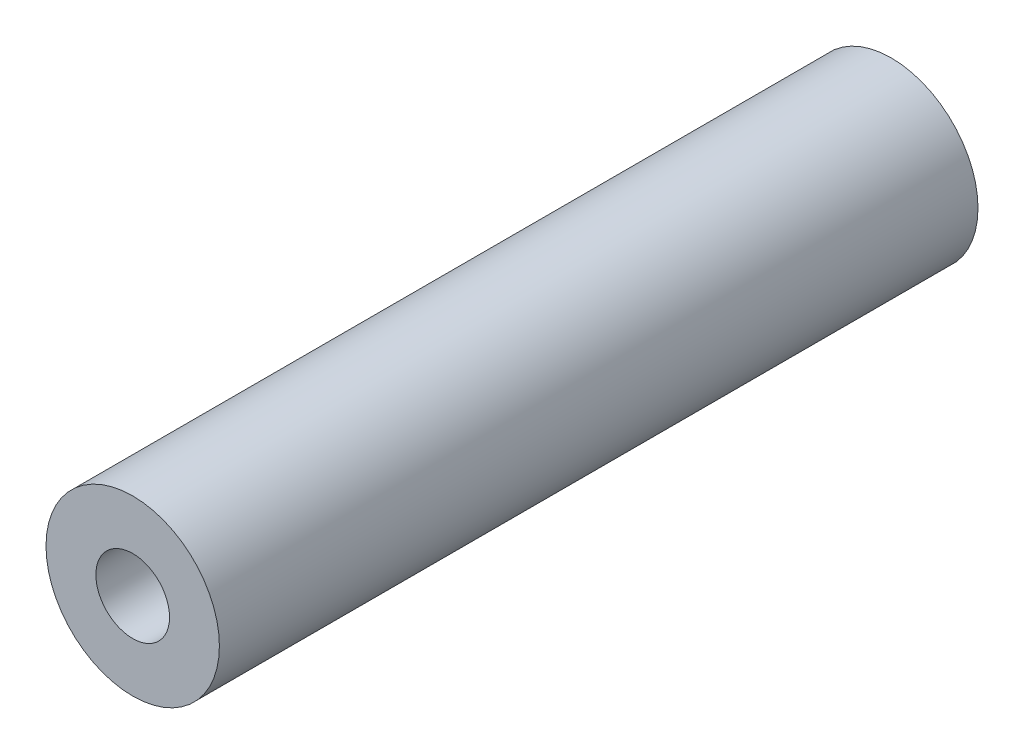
from build123d import *

# Parameters (mm, degrees)
SKETCH_1_R                  = 4
SKETCH_1_R_2                = 1.7
M3_CLEARANCE_STANDOFF_DEPTH = 35


with BuildPart() as part:
    # Sketch 1 → M3_clearance_standoff (new body)
    with BuildSketch(Plane.XY):
        Circle(SKETCH_1_R)
        Circle(SKETCH_1_R_2, mode=Mode.SUBTRACT)
    extrude(amount=M3_CLEARANCE_STANDOFF_DEPTH)


solid = part.part
